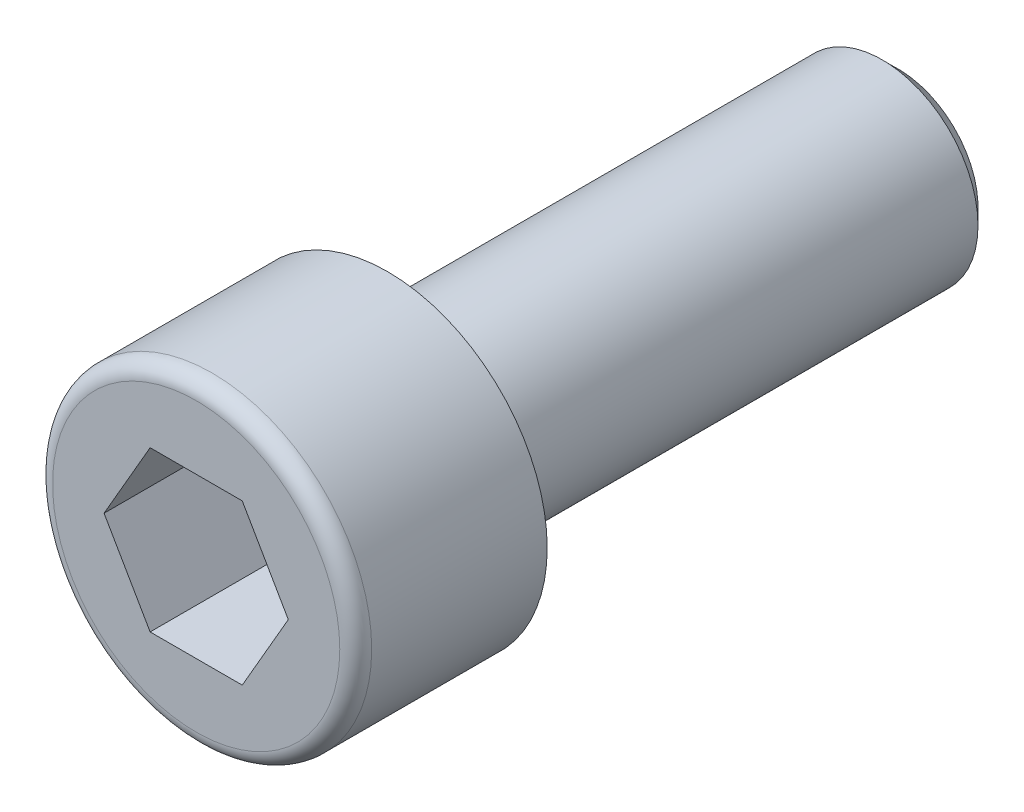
from build123d import *

# Parameters (mm, degrees)
ESQUISSE1_R             = 5
BASE_EXTRUSION_DEPTH    = 6
ESQUISSE2_R             = 3
BOSS_EXTRU_1_DEPTH      = 16
CHANFREIN1_SIZE         = 0.5
ENL_V_MAT_EXTRU_1_DEPTH = 4
CONG_1_R                = 0.5


with BuildPart() as part:
    # Esquisse1 → Base-Extrusion (new body)
    with BuildSketch(Plane.XY):
        Circle(ESQUISSE1_R)
    extrude(amount=BASE_EXTRUSION_DEPTH)

    # Esquisse2 → Boss.-Extru.1 (add)
    with BuildSketch(Plane(origin=(0, 0, 0), x_dir=(-1, 0, 0), z_dir=(0, 0, -1))):
        with Locations(Location((0, 0, 0), (0, 0, 180))):
            Circle(ESQUISSE2_R)
    extrude(amount=BOSS_EXTRU_1_DEPTH)

    # Chanfrein1
    chanfrein1_edges = [part.edges().sort_by_distance(p)[0] for p in [
        (-3, 0, -16),
    ]]
    chamfer(chanfrein1_edges, length=CHANFREIN1_SIZE)

    # Esquisse3 → Enl_v. mat.-Extru.1 (cut)
    with BuildSketch(Plane.XY.offset(6)):
        Polygon((2.886751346, 0), (1.443375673, 2.5), (-1.443375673, 2.5), (-2.886751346, 0), (-1.443375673, -2.5), (1.443375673, -2.5), align=None)
    extrude(amount=-ENL_V_MAT_EXTRU_1_DEPTH, mode=Mode.SUBTRACT)

    # Cong_1
    cong_1_edges = [part.edges().sort_by_distance(p)[0] for p in [
        (-5, 0, 6),
    ]]
    fillet(cong_1_edges, radius=CONG_1_R)


solid = part.part
